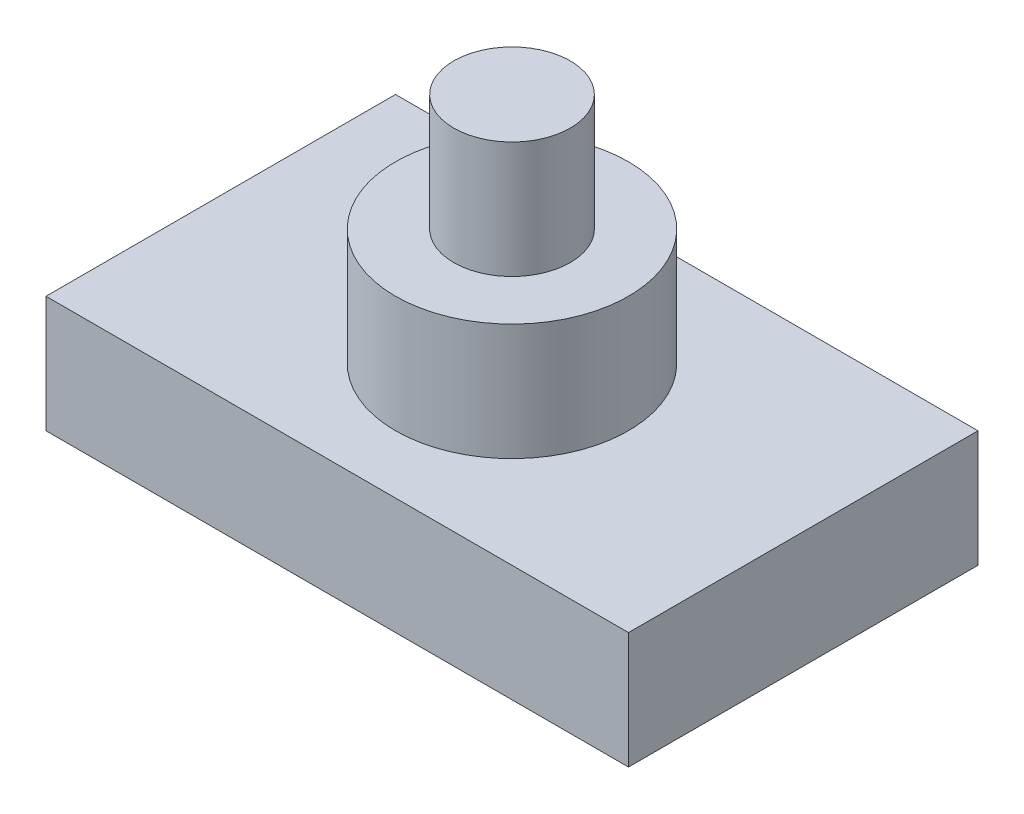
from build123d import *

# Parameters (mm, degrees)
SKETCH_1_W      = 50
SKETCH_1_H      = 30
EXTRUDE_1_DEPTH = 10
SKETCH_3_R      = 10
EXTRUDE_3_DEPTH = 10
SKETCH_2_R      = 5
EXTRUDE_2_DEPTH = 10


with BuildPart() as part:
    # Sketch 1 → Extrude 1 (new body)
    with BuildSketch(Plane(origin=(0, 0, 0), x_dir=(1, 0, 0), z_dir=(0, 1, 0))):
        Rectangle(SKETCH_1_W, SKETCH_1_H)
    extrude(amount=EXTRUDE_1_DEPTH)

    # Sketch 3 → Extrude 3 (add)
    with BuildSketch(Plane(origin=(0, 10, 0), x_dir=(1, 0, 0), z_dir=(0, 1, 0))):
        with Locations(Location((0, 0, 0), (0, 0, 270))):
            Circle(SKETCH_3_R)
    extrude(amount=EXTRUDE_3_DEPTH)

    # Sketch 2 → Extrude 2 (add)
    with BuildSketch(Plane(origin=(0, 20, 0), x_dir=(1, 0, 0), z_dir=(0, 1, 0))):
        with Locations(Location((0, 0, 0), (0, 0, 270))):
            Circle(SKETCH_2_R)
    extrude(amount=EXTRUDE_2_DEPTH)


solid = part.part
